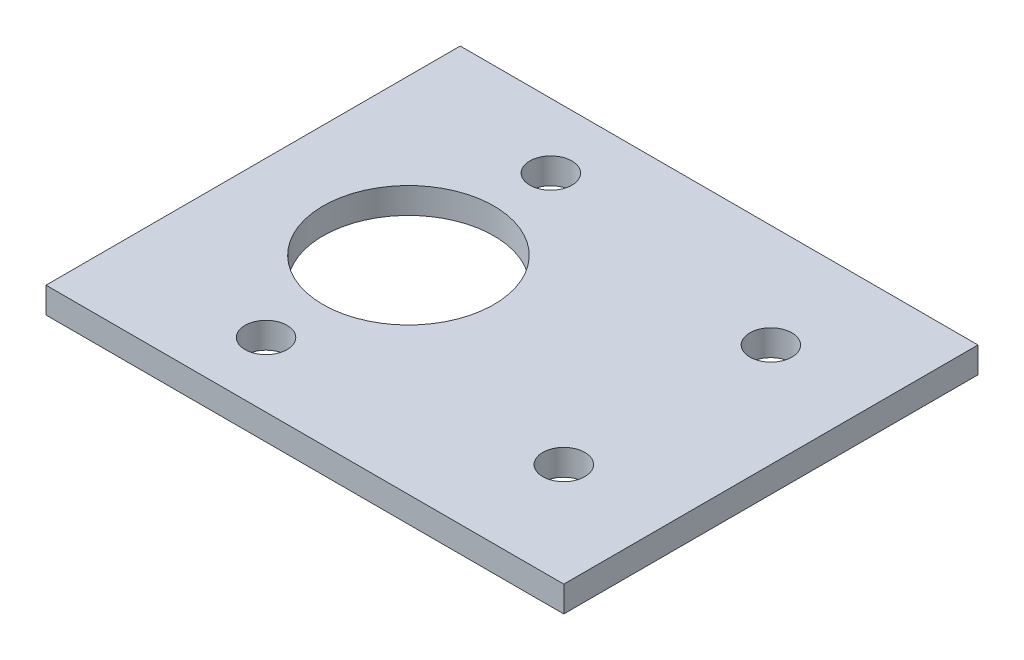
ISO-10303-21;
HEADER;
FILE_DESCRIPTION(('STEP AP214'),'2;1');
FILE_NAME('part.step','',(''),(''),'','','');
FILE_SCHEMA(('AUTOMOTIVE_DESIGN { 1 0 10303 214 1 1 1 1 }'));
ENDSEC;
DATA;
#1=APPLICATION_CONTEXT('core data for automotive mechanical design processes');
#2=APPLICATION_PROTOCOL_DEFINITION('international standard','automotive_design',2000,#1);
#3=PRODUCT_CONTEXT('',#1,'mechanical');
#4=PRODUCT('Part','Part','',(#3));
#5=PRODUCT_RELATED_PRODUCT_CATEGORY('part','',(#4));
#6=PRODUCT_DEFINITION_FORMATION('','',#4);
#7=PRODUCT_DEFINITION_CONTEXT('part definition',#1,'design');
#8=PRODUCT_DEFINITION('design','',#6,#7);
#9=PRODUCT_DEFINITION_SHAPE('','',#8);
#10=(LENGTH_UNIT() NAMED_UNIT(*) SI_UNIT(.MILLI.,.METRE.));
#11=(NAMED_UNIT(*) PLANE_ANGLE_UNIT() SI_UNIT($,.RADIAN.));
#12=(NAMED_UNIT(*) SI_UNIT($,.STERADIAN.) SOLID_ANGLE_UNIT());
#13=UNCERTAINTY_MEASURE_WITH_UNIT(LENGTH_MEASURE(1.E-05),#10,'distance_accuracy_value','');
#14=(GEOMETRIC_REPRESENTATION_CONTEXT(3) GLOBAL_UNCERTAINTY_ASSIGNED_CONTEXT((#13)) GLOBAL_UNIT_ASSIGNED_CONTEXT((#10,
#11,#12)) REPRESENTATION_CONTEXT('',''));
#15=CARTESIAN_POINT('',(0.,0.,0.));
#16=DIRECTION('',(0.,0.,1.));
#17=DIRECTION('',(1.,0.,0.));
#18=AXIS2_PLACEMENT_3D('',#15,#16,#17);
#19=CARTESIAN_POINT('',(0.,12.7,0.));
#20=DIRECTION('',(-1.,0.,0.));
#21=DIRECTION('',(0.,0.,1.));
#22=AXIS2_PLACEMENT_3D('',#19,#20,#21);
#23=PLANE('',#22);
#24=DIRECTION('',(0.,0.,-1.));
#25=VECTOR('',#24,1.);
#26=CARTESIAN_POINT('',(0.,0.,0.));
#27=LINE('',#26,#25);
#28=CARTESIAN_POINT('',(0.,0.,203.2));
#29=VERTEX_POINT('',#28);
#30=CARTESIAN_POINT('',(0.,0.,0.));
#31=VERTEX_POINT('',#30);
#32=EDGE_CURVE('E94',#29,#31,#27,.T.);
#33=ORIENTED_EDGE('',*,*,#32,.T.);
#34=DIRECTION('',(0.,-1.,0.));
#35=VECTOR('',#34,1.);
#36=CARTESIAN_POINT('',(0.,12.7,0.));
#37=LINE('',#36,#35);
#38=CARTESIAN_POINT('',(0.,12.7,0.));
#39=VERTEX_POINT('',#38);
#40=EDGE_CURVE('E11',#39,#31,#37,.T.);
#41=ORIENTED_EDGE('',*,*,#40,.F.);
#42=DIRECTION('',(0.,0.,-1.));
#43=VECTOR('',#42,1.);
#44=CARTESIAN_POINT('',(0.,12.7,0.));
#45=LINE('',#44,#43);
#46=CARTESIAN_POINT('',(0.,12.7,203.2));
#47=VERTEX_POINT('',#46);
#48=EDGE_CURVE('E82',#47,#39,#45,.T.);
#49=ORIENTED_EDGE('',*,*,#48,.F.);
#50=DIRECTION('',(0.,-1.,0.));
#51=VECTOR('',#50,1.);
#52=CARTESIAN_POINT('',(0.,12.7,203.2));
#53=LINE('',#52,#51);
#54=EDGE_CURVE('E90',#47,#29,#53,.T.);
#55=ORIENTED_EDGE('',*,*,#54,.T.);
#56=EDGE_LOOP('',(#33,#41,#49,#55));
#57=FACE_BOUND('',#56,.T.);
#58=ADVANCED_FACE('F31',(#57),#23,.F.);
#59=CARTESIAN_POINT('',(0.,12.7,0.));
#60=DIRECTION('',(0.,0.,1.));
#61=DIRECTION('',(1.,0.,0.));
#62=AXIS2_PLACEMENT_3D('',#59,#60,#61);
#63=PLANE('',#62);
#64=DIRECTION('',(-1.,0.,0.));
#65=VECTOR('',#64,1.);
#66=CARTESIAN_POINT('',(0.,0.,0.));
#67=LINE('',#66,#65);
#68=CARTESIAN_POINT('',(-254.,0.,0.));
#69=VERTEX_POINT('',#68);
#70=EDGE_CURVE('E86',#31,#69,#67,.T.);
#71=ORIENTED_EDGE('',*,*,#70,.T.);
#72=DIRECTION('',(0.,-1.,0.));
#73=VECTOR('',#72,1.);
#74=CARTESIAN_POINT('',(-254.,12.7,0.));
#75=LINE('',#74,#73);
#76=CARTESIAN_POINT('',(-254.,12.7,0.));
#77=VERTEX_POINT('',#76);
#78=EDGE_CURVE('E39',#77,#69,#75,.T.);
#79=ORIENTED_EDGE('',*,*,#78,.F.);
#80=DIRECTION('',(-1.,0.,0.));
#81=VECTOR('',#80,1.);
#82=CARTESIAN_POINT('',(0.,12.7,0.));
#83=LINE('',#82,#81);
#84=EDGE_CURVE('E77',#39,#77,#83,.T.);
#85=ORIENTED_EDGE('',*,*,#84,.F.);
#86=ORIENTED_EDGE('',*,*,#40,.T.);
#87=EDGE_LOOP('',(#71,#79,#85,#86));
#88=FACE_BOUND('',#87,.T.);
#89=ADVANCED_FACE('F85',(#88),#63,.F.);
#90=CARTESIAN_POINT('',(-254.,12.7,0.));
#91=DIRECTION('',(1.,0.,0.));
#92=DIRECTION('',(0.,0.,-1.));
#93=AXIS2_PLACEMENT_3D('',#90,#91,#92);
#94=PLANE('',#93);
#95=DIRECTION('',(0.,0.,1.));
#96=VECTOR('',#95,1.);
#97=CARTESIAN_POINT('',(-254.,0.,0.));
#98=LINE('',#97,#96);
#99=CARTESIAN_POINT('',(-254.,0.,203.2));
#100=VERTEX_POINT('',#99);
#101=EDGE_CURVE('E64',#69,#100,#98,.T.);
#102=ORIENTED_EDGE('',*,*,#101,.T.);
#103=DIRECTION('',(0.,-1.,0.));
#104=VECTOR('',#103,1.);
#105=CARTESIAN_POINT('',(-254.,12.7,203.2));
#106=LINE('',#105,#104);
#107=CARTESIAN_POINT('',(-254.,12.7,203.2));
#108=VERTEX_POINT('',#107);
#109=EDGE_CURVE('E87',#108,#100,#106,.T.);
#110=ORIENTED_EDGE('',*,*,#109,.F.);
#111=DIRECTION('',(0.,0.,1.));
#112=VECTOR('',#111,1.);
#113=CARTESIAN_POINT('',(-254.,12.7,0.));
#114=LINE('',#113,#112);
#115=EDGE_CURVE('E80',#77,#108,#114,.T.);
#116=ORIENTED_EDGE('',*,*,#115,.F.);
#117=ORIENTED_EDGE('',*,*,#78,.T.);
#118=EDGE_LOOP('',(#102,#110,#116,#117));
#119=FACE_BOUND('',#118,.T.);
#120=ADVANCED_FACE('F88',(#119),#94,.F.);
#121=CARTESIAN_POINT('',(0.,12.7,203.2));
#122=DIRECTION('',(0.,0.,-1.));
#123=DIRECTION('',(-1.,0.,0.));
#124=AXIS2_PLACEMENT_3D('',#121,#122,#123);
#125=PLANE('',#124);
#126=DIRECTION('',(1.,0.,0.));
#127=VECTOR('',#126,1.);
#128=CARTESIAN_POINT('',(0.,0.,203.2));
#129=LINE('',#128,#127);
#130=EDGE_CURVE('E70',#100,#29,#129,.T.);
#131=ORIENTED_EDGE('',*,*,#130,.T.);
#132=ORIENTED_EDGE('',*,*,#54,.F.);
#133=DIRECTION('',(1.,0.,0.));
#134=VECTOR('',#133,1.);
#135=CARTESIAN_POINT('',(0.,12.7,203.2));
#136=LINE('',#135,#134);
#137=EDGE_CURVE('E47',#108,#47,#136,.T.);
#138=ORIENTED_EDGE('',*,*,#137,.F.);
#139=ORIENTED_EDGE('',*,*,#109,.T.);
#140=EDGE_LOOP('',(#131,#132,#138,#139));
#141=FACE_BOUND('',#140,.T.);
#142=ADVANCED_FACE('F102',(#141),#125,.F.);
#143=CARTESIAN_POINT('',(0.,12.7,0.));
#144=DIRECTION('',(0.,-1.,0.));
#145=DIRECTION('',(0.,0.,-1.));
#146=AXIS2_PLACEMENT_3D('',#143,#144,#145);
#147=PLANE('',#146);
#148=CARTESIAN_POINT('',(-177.8,12.7,31.75));
#149=DIRECTION('',(0.,1.,0.));
#150=DIRECTION('',(0.,0.,1.));
#151=AXIS2_PLACEMENT_3D('',#148,#149,#150);
#152=CIRCLE('',#151,10.31875);
#153=CARTESIAN_POINT('',(-177.8,12.7,42.06875));
#154=VERTEX_POINT('',#153);
#155=EDGE_CURVE('E132',#154,#154,#152,.T.);
#156=ORIENTED_EDGE('',*,*,#155,.F.);
#157=EDGE_LOOP('',(#156));
#158=FACE_BOUND('',#157,.T.);
#159=CARTESIAN_POINT('',(-177.8,12.7,171.45));
#160=DIRECTION('',(0.,1.,0.));
#161=DIRECTION('',(0.,0.,1.));
#162=AXIS2_PLACEMENT_3D('',#159,#160,#161);
#163=CIRCLE('',#162,10.31875);
#164=CARTESIAN_POINT('',(-177.8,12.7,181.76875));
#165=VERTEX_POINT('',#164);
#166=EDGE_CURVE('E126',#165,#165,#163,.T.);
#167=ORIENTED_EDGE('',*,*,#166,.F.);
#168=EDGE_LOOP('',(#167));
#169=FACE_BOUND('',#168,.T.);
#170=CARTESIAN_POINT('',(-177.8,12.7,101.6));
#171=DIRECTION('',(0.,1.,0.));
#172=DIRECTION('',(0.,0.,1.));
#173=AXIS2_PLACEMENT_3D('',#170,#171,#172);
#174=CIRCLE('',#173,41.91);
#175=CARTESIAN_POINT('',(-177.8,12.7,143.51));
#176=VERTEX_POINT('',#175);
#177=EDGE_CURVE('E120',#176,#176,#174,.T.);
#178=ORIENTED_EDGE('',*,*,#177,.F.);
#179=EDGE_LOOP('',(#178));
#180=FACE_BOUND('',#179,.T.);
#181=CARTESIAN_POINT('',(-50.8,12.7,152.4));
#182=DIRECTION('',(0.,1.,0.));
#183=DIRECTION('',(0.,0.,1.));
#184=AXIS2_PLACEMENT_3D('',#181,#182,#183);
#185=CIRCLE('',#184,10.31875);
#186=CARTESIAN_POINT('',(-50.8,12.7,162.71875));
#187=VERTEX_POINT('',#186);
#188=EDGE_CURVE('E114',#187,#187,#185,.T.);
#189=ORIENTED_EDGE('',*,*,#188,.F.);
#190=EDGE_LOOP('',(#189));
#191=FACE_BOUND('',#190,.T.);
#192=CARTESIAN_POINT('',(-50.8,12.7,50.8));
#193=DIRECTION('',(0.,1.,0.));
#194=DIRECTION('',(0.,0.,1.));
#195=AXIS2_PLACEMENT_3D('',#192,#193,#194);
#196=CIRCLE('',#195,10.31875);
#197=CARTESIAN_POINT('',(-50.8,12.7,61.11875));
#198=VERTEX_POINT('',#197);
#199=EDGE_CURVE('E108',#198,#198,#196,.T.);
#200=ORIENTED_EDGE('',*,*,#199,.F.);
#201=EDGE_LOOP('',(#200));
#202=FACE_BOUND('',#201,.T.);
#203=ORIENTED_EDGE('',*,*,#48,.T.);
#204=ORIENTED_EDGE('',*,*,#84,.T.);
#205=ORIENTED_EDGE('',*,*,#115,.T.);
#206=ORIENTED_EDGE('',*,*,#137,.T.);
#207=EDGE_LOOP('',(#203,#204,#205,#206));
#208=FACE_BOUND('',#207,.T.);
#209=ADVANCED_FACE('F78',(#158,#169,#180,#191,#202,#208),#147,.F.);
#210=CARTESIAN_POINT('',(0.,0.,0.));
#211=DIRECTION('',(0.,-1.,0.));
#212=DIRECTION('',(0.,0.,-1.));
#213=AXIS2_PLACEMENT_3D('',#210,#211,#212);
#214=PLANE('',#213);
#215=CARTESIAN_POINT('',(-177.8,0.,31.75));
#216=DIRECTION('',(0.,1.,0.));
#217=DIRECTION('',(0.,0.,1.));
#218=AXIS2_PLACEMENT_3D('',#215,#216,#217);
#219=CIRCLE('',#218,10.31875);
#220=CARTESIAN_POINT('',(-177.8,0.,42.06875));
#221=VERTEX_POINT('',#220);
#222=EDGE_CURVE('E129',#221,#221,#219,.T.);
#223=ORIENTED_EDGE('',*,*,#222,.T.);
#224=EDGE_LOOP('',(#223));
#225=FACE_BOUND('',#224,.T.);
#226=CARTESIAN_POINT('',(-177.8,0.,171.45));
#227=DIRECTION('',(0.,1.,0.));
#228=DIRECTION('',(0.,0.,1.));
#229=AXIS2_PLACEMENT_3D('',#226,#227,#228);
#230=CIRCLE('',#229,10.31875);
#231=CARTESIAN_POINT('',(-177.8,0.,181.76875));
#232=VERTEX_POINT('',#231);
#233=EDGE_CURVE('E123',#232,#232,#230,.T.);
#234=ORIENTED_EDGE('',*,*,#233,.T.);
#235=EDGE_LOOP('',(#234));
#236=FACE_BOUND('',#235,.T.);
#237=CARTESIAN_POINT('',(-177.8,0.,101.6));
#238=DIRECTION('',(0.,1.,0.));
#239=DIRECTION('',(0.,0.,1.));
#240=AXIS2_PLACEMENT_3D('',#237,#238,#239);
#241=CIRCLE('',#240,41.91);
#242=CARTESIAN_POINT('',(-177.8,0.,143.51));
#243=VERTEX_POINT('',#242);
#244=EDGE_CURVE('E117',#243,#243,#241,.T.);
#245=ORIENTED_EDGE('',*,*,#244,.T.);
#246=EDGE_LOOP('',(#245));
#247=FACE_BOUND('',#246,.T.);
#248=CARTESIAN_POINT('',(-50.8,0.,152.4));
#249=DIRECTION('',(0.,1.,0.));
#250=DIRECTION('',(0.,0.,1.));
#251=AXIS2_PLACEMENT_3D('',#248,#249,#250);
#252=CIRCLE('',#251,10.31875);
#253=CARTESIAN_POINT('',(-50.8,0.,162.71875));
#254=VERTEX_POINT('',#253);
#255=EDGE_CURVE('E111',#254,#254,#252,.T.);
#256=ORIENTED_EDGE('',*,*,#255,.T.);
#257=EDGE_LOOP('',(#256));
#258=FACE_BOUND('',#257,.T.);
#259=CARTESIAN_POINT('',(-50.8,0.,50.8));
#260=DIRECTION('',(0.,1.,0.));
#261=DIRECTION('',(0.,0.,1.));
#262=AXIS2_PLACEMENT_3D('',#259,#260,#261);
#263=CIRCLE('',#262,10.31875);
#264=CARTESIAN_POINT('',(-50.8,0.,61.11875));
#265=VERTEX_POINT('',#264);
#266=EDGE_CURVE('E97',#265,#265,#263,.T.);
#267=ORIENTED_EDGE('',*,*,#266,.T.);
#268=EDGE_LOOP('',(#267));
#269=FACE_BOUND('',#268,.T.);
#270=ORIENTED_EDGE('',*,*,#32,.F.);
#271=ORIENTED_EDGE('',*,*,#130,.F.);
#272=ORIENTED_EDGE('',*,*,#101,.F.);
#273=ORIENTED_EDGE('',*,*,#70,.F.);
#274=EDGE_LOOP('',(#270,#271,#272,#273));
#275=FACE_BOUND('',#274,.T.);
#276=ADVANCED_FACE('F105',(#225,#236,#247,#258,#269,#275),#214,.T.);
#277=CARTESIAN_POINT('',(-50.8,0.,50.8));
#278=DIRECTION('',(0.,1.,0.));
#279=DIRECTION('',(0.,0.,1.));
#280=AXIS2_PLACEMENT_3D('',#277,#278,#279);
#281=CYLINDRICAL_SURFACE('',#280,10.31875);
#282=ORIENTED_EDGE('',*,*,#266,.F.);
#283=EDGE_LOOP('',(#282));
#284=FACE_BOUND('',#283,.T.);
#285=ORIENTED_EDGE('',*,*,#199,.T.);
#286=EDGE_LOOP('',(#285));
#287=FACE_BOUND('',#286,.T.);
#288=ADVANCED_FACE('F158',(#284,#287),#281,.F.);
#289=CARTESIAN_POINT('',(-50.8,0.,152.4));
#290=DIRECTION('',(0.,1.,0.));
#291=DIRECTION('',(0.,0.,1.));
#292=AXIS2_PLACEMENT_3D('',#289,#290,#291);
#293=CYLINDRICAL_SURFACE('',#292,10.31875);
#294=ORIENTED_EDGE('',*,*,#255,.F.);
#295=EDGE_LOOP('',(#294));
#296=FACE_BOUND('',#295,.T.);
#297=ORIENTED_EDGE('',*,*,#188,.T.);
#298=EDGE_LOOP('',(#297));
#299=FACE_BOUND('',#298,.T.);
#300=ADVANCED_FACE('F160',(#296,#299),#293,.F.);
#301=CARTESIAN_POINT('',(-177.8,0.,101.6));
#302=DIRECTION('',(0.,1.,0.));
#303=DIRECTION('',(0.,0.,1.));
#304=AXIS2_PLACEMENT_3D('',#301,#302,#303);
#305=CYLINDRICAL_SURFACE('',#304,41.91);
#306=ORIENTED_EDGE('',*,*,#244,.F.);
#307=EDGE_LOOP('',(#306));
#308=FACE_BOUND('',#307,.T.);
#309=ORIENTED_EDGE('',*,*,#177,.T.);
#310=EDGE_LOOP('',(#309));
#311=FACE_BOUND('',#310,.T.);
#312=ADVANCED_FACE('F167',(#308,#311),#305,.F.);
#313=CARTESIAN_POINT('',(-177.8,0.,171.45));
#314=DIRECTION('',(0.,1.,0.));
#315=DIRECTION('',(0.,0.,1.));
#316=AXIS2_PLACEMENT_3D('',#313,#314,#315);
#317=CYLINDRICAL_SURFACE('',#316,10.31875);
#318=CARTESIAN_POINT('',(-177.8,0.,181.76875));
#319=CARTESIAN_POINT('',(-177.8,0.132291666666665,181.76875));
#320=CARTESIAN_POINT('',(-177.8,0.264583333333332,181.76875));
#321=CARTESIAN_POINT('',(-177.8,0.529166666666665,181.76875));
#322=CARTESIAN_POINT('',(-177.8,0.661458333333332,181.76875));
#323=CARTESIAN_POINT('',(-177.8,0.926041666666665,181.76875));
#324=CARTESIAN_POINT('',(-177.8,1.05833333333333,181.76875));
#325=CARTESIAN_POINT('',(-177.8,1.32291666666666,181.76875));
#326=CARTESIAN_POINT('',(-177.8,1.45520833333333,181.76875));
#327=CARTESIAN_POINT('',(-177.8,1.71979166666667,181.76875));
#328=CARTESIAN_POINT('',(-177.8,1.85208333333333,181.76875));
#329=CARTESIAN_POINT('',(-177.8,2.11666666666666,181.76875));
#330=CARTESIAN_POINT('',(-177.8,2.24895833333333,181.76875));
#331=CARTESIAN_POINT('',(-177.8,2.51354166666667,181.76875));
#332=CARTESIAN_POINT('',(-177.8,2.64583333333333,181.76875));
#333=CARTESIAN_POINT('',(-177.8,2.91041666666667,181.76875));
#334=CARTESIAN_POINT('',(-177.8,3.04270833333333,181.76875));
#335=CARTESIAN_POINT('',(-177.8,3.30729166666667,181.76875));
#336=CARTESIAN_POINT('',(-177.8,3.43958333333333,181.76875));
#337=CARTESIAN_POINT('',(-177.8,3.70416666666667,181.76875));
#338=CARTESIAN_POINT('',(-177.8,3.83645833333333,181.76875));
#339=CARTESIAN_POINT('',(-177.8,4.10104166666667,181.76875));
#340=CARTESIAN_POINT('',(-177.8,4.23333333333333,181.76875));
#341=CARTESIAN_POINT('',(-177.8,4.49791666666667,181.76875));
#342=CARTESIAN_POINT('',(-177.8,4.63020833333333,181.76875));
#343=CARTESIAN_POINT('',(-177.8,4.89479166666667,181.76875));
#344=CARTESIAN_POINT('',(-177.8,5.02708333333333,181.76875));
#345=CARTESIAN_POINT('',(-177.8,5.29166666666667,181.76875));
#346=CARTESIAN_POINT('',(-177.8,5.42395833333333,181.76875));
#347=CARTESIAN_POINT('',(-177.8,5.68854166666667,181.76875));
#348=CARTESIAN_POINT('',(-177.8,5.82083333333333,181.76875));
#349=CARTESIAN_POINT('',(-177.8,6.08541666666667,181.76875));
#350=CARTESIAN_POINT('',(-177.8,6.21770833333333,181.76875));
#351=CARTESIAN_POINT('',(-177.8,6.48229166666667,181.76875));
#352=CARTESIAN_POINT('',(-177.8,6.61458333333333,181.76875));
#353=CARTESIAN_POINT('',(-177.8,6.87916666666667,181.76875));
#354=CARTESIAN_POINT('',(-177.8,7.01145833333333,181.76875));
#355=CARTESIAN_POINT('',(-177.8,7.27604166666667,181.76875));
#356=CARTESIAN_POINT('',(-177.8,7.40833333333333,181.76875));
#357=CARTESIAN_POINT('',(-177.8,7.67291666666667,181.76875));
#358=CARTESIAN_POINT('',(-177.8,7.80520833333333,181.76875));
#359=CARTESIAN_POINT('',(-177.8,8.06979166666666,181.76875));
#360=CARTESIAN_POINT('',(-177.8,8.20208333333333,181.76875));
#361=CARTESIAN_POINT('',(-177.8,8.46666666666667,181.76875));
#362=CARTESIAN_POINT('',(-177.8,8.59895833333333,181.76875));
#363=CARTESIAN_POINT('',(-177.8,8.86354166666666,181.76875));
#364=CARTESIAN_POINT('',(-177.8,8.99583333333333,181.76875));
#365=CARTESIAN_POINT('',(-177.8,9.26041666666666,181.76875));
#366=CARTESIAN_POINT('',(-177.8,9.39270833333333,181.76875));
#367=CARTESIAN_POINT('',(-177.8,9.65729166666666,181.76875));
#368=CARTESIAN_POINT('',(-177.8,9.78958333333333,181.76875));
#369=CARTESIAN_POINT('',(-177.8,10.0541666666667,181.76875));
#370=CARTESIAN_POINT('',(-177.8,10.1864583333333,181.76875));
#371=CARTESIAN_POINT('',(-177.8,10.4510416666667,181.76875));
#372=CARTESIAN_POINT('',(-177.8,10.5833333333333,181.76875));
#373=CARTESIAN_POINT('',(-177.8,10.8479166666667,181.76875));
#374=CARTESIAN_POINT('',(-177.8,10.9802083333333,181.76875));
#375=CARTESIAN_POINT('',(-177.8,11.2447916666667,181.76875));
#376=CARTESIAN_POINT('',(-177.8,11.3770833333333,181.76875));
#377=CARTESIAN_POINT('',(-177.8,11.6416666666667,181.76875));
#378=CARTESIAN_POINT('',(-177.8,11.7739583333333,181.76875));
#379=CARTESIAN_POINT('',(-177.8,12.0385416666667,181.76875));
#380=CARTESIAN_POINT('',(-177.8,12.1708333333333,181.76875));
#381=CARTESIAN_POINT('',(-177.8,12.4354166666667,181.76875));
#382=CARTESIAN_POINT('',(-177.8,12.5677083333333,181.76875));
#383=CARTESIAN_POINT('',(-177.8,12.7,181.76875));
#384=B_SPLINE_CURVE_WITH_KNOTS('',3,(#318,#319,#320,#321,#322,#323,#324,#325,#326,#327,#328,
#329,#330,#331,#332,#333,#334,#335,#336,#337,#338,#339,#340,#341,#342,#343,#344,#345,#346,#347,
#348,#349,#350,#351,#352,#353,#354,#355,#356,#357,#358,#359,#360,#361,#362,#363,#364,#365,#366,
#367,#368,#369,#370,#371,#372,#373,#374,#375,#376,#377,#378,#379,#380,#381,#382,#383),
.UNSPECIFIED.,.F.,.F.,(4,2,2,2,2,2,2,2,2,2,2,2,2,2,2,2,2,2,2,2,2,2,2,2,2,2,2,2,2,2,2,2,4),(0.,
0.396875,0.79375,1.190625,1.5875,1.984375,2.38125,2.778125,3.175,3.571875,3.96875,4.365625,
4.7625,5.159375,5.55625,5.953125,6.35,6.746875,7.14375,7.540625,7.9375,8.334375,8.73125,
9.128125,9.525,9.921875,10.31875,10.715625,11.1125,11.509375,11.90625,12.303125,12.7),.UNSPECIFIED.);
#385=EDGE_CURVE('BSEAM143',#232,#165,#384,.T.);
#386=ORIENTED_EDGE('',*,*,#233,.F.);
#387=ORIENTED_EDGE('',*,*,#166,.T.);
#388=ORIENTED_EDGE('',*,*,#385,.T.);
#389=ORIENTED_EDGE('',*,*,#385,.F.);
#390=EDGE_LOOP('',(#386,#388,#387,#389));
#391=FACE_BOUND('',#390,.T.);
#392=ADVANCED_FACE('F143',(#391),#317,.F.);
#393=CARTESIAN_POINT('',(-177.8,0.,31.75));
#394=DIRECTION('',(0.,1.,0.));
#395=DIRECTION('',(0.,0.,1.));
#396=AXIS2_PLACEMENT_3D('',#393,#394,#395);
#397=CYLINDRICAL_SURFACE('',#396,10.31875);
#398=CARTESIAN_POINT('',(-177.8,0.,42.06875));
#399=CARTESIAN_POINT('',(-177.8,0.132291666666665,42.06875));
#400=CARTESIAN_POINT('',(-177.8,0.264583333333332,42.06875));
#401=CARTESIAN_POINT('',(-177.8,0.529166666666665,42.06875));
#402=CARTESIAN_POINT('',(-177.8,0.661458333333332,42.06875));
#403=CARTESIAN_POINT('',(-177.8,0.926041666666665,42.06875));
#404=CARTESIAN_POINT('',(-177.8,1.05833333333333,42.06875));
#405=CARTESIAN_POINT('',(-177.8,1.32291666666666,42.06875));
#406=CARTESIAN_POINT('',(-177.8,1.45520833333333,42.06875));
#407=CARTESIAN_POINT('',(-177.8,1.71979166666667,42.06875));
#408=CARTESIAN_POINT('',(-177.8,1.85208333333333,42.06875));
#409=CARTESIAN_POINT('',(-177.8,2.11666666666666,42.06875));
#410=CARTESIAN_POINT('',(-177.8,2.24895833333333,42.06875));
#411=CARTESIAN_POINT('',(-177.8,2.51354166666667,42.06875));
#412=CARTESIAN_POINT('',(-177.8,2.64583333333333,42.06875));
#413=CARTESIAN_POINT('',(-177.8,2.91041666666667,42.06875));
#414=CARTESIAN_POINT('',(-177.8,3.04270833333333,42.06875));
#415=CARTESIAN_POINT('',(-177.8,3.30729166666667,42.06875));
#416=CARTESIAN_POINT('',(-177.8,3.43958333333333,42.06875));
#417=CARTESIAN_POINT('',(-177.8,3.70416666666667,42.06875));
#418=CARTESIAN_POINT('',(-177.8,3.83645833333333,42.06875));
#419=CARTESIAN_POINT('',(-177.8,4.10104166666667,42.06875));
#420=CARTESIAN_POINT('',(-177.8,4.23333333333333,42.06875));
#421=CARTESIAN_POINT('',(-177.8,4.49791666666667,42.06875));
#422=CARTESIAN_POINT('',(-177.8,4.63020833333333,42.06875));
#423=CARTESIAN_POINT('',(-177.8,4.89479166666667,42.06875));
#424=CARTESIAN_POINT('',(-177.8,5.02708333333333,42.06875));
#425=CARTESIAN_POINT('',(-177.8,5.29166666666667,42.06875));
#426=CARTESIAN_POINT('',(-177.8,5.42395833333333,42.06875));
#427=CARTESIAN_POINT('',(-177.8,5.68854166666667,42.06875));
#428=CARTESIAN_POINT('',(-177.8,5.82083333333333,42.06875));
#429=CARTESIAN_POINT('',(-177.8,6.08541666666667,42.06875));
#430=CARTESIAN_POINT('',(-177.8,6.21770833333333,42.06875));
#431=CARTESIAN_POINT('',(-177.8,6.48229166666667,42.06875));
#432=CARTESIAN_POINT('',(-177.8,6.61458333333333,42.06875));
#433=CARTESIAN_POINT('',(-177.8,6.87916666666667,42.06875));
#434=CARTESIAN_POINT('',(-177.8,7.01145833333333,42.06875));
#435=CARTESIAN_POINT('',(-177.8,7.27604166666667,42.06875));
#436=CARTESIAN_POINT('',(-177.8,7.40833333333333,42.06875));
#437=CARTESIAN_POINT('',(-177.8,7.67291666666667,42.06875));
#438=CARTESIAN_POINT('',(-177.8,7.80520833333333,42.06875));
#439=CARTESIAN_POINT('',(-177.8,8.06979166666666,42.06875));
#440=CARTESIAN_POINT('',(-177.8,8.20208333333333,42.06875));
#441=CARTESIAN_POINT('',(-177.8,8.46666666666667,42.06875));
#442=CARTESIAN_POINT('',(-177.8,8.59895833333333,42.06875));
#443=CARTESIAN_POINT('',(-177.8,8.86354166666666,42.06875));
#444=CARTESIAN_POINT('',(-177.8,8.99583333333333,42.06875));
#445=CARTESIAN_POINT('',(-177.8,9.26041666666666,42.06875));
#446=CARTESIAN_POINT('',(-177.8,9.39270833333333,42.06875));
#447=CARTESIAN_POINT('',(-177.8,9.65729166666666,42.06875));
#448=CARTESIAN_POINT('',(-177.8,9.78958333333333,42.06875));
#449=CARTESIAN_POINT('',(-177.8,10.0541666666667,42.06875));
#450=CARTESIAN_POINT('',(-177.8,10.1864583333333,42.06875));
#451=CARTESIAN_POINT('',(-177.8,10.4510416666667,42.06875));
#452=CARTESIAN_POINT('',(-177.8,10.5833333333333,42.06875));
#453=CARTESIAN_POINT('',(-177.8,10.8479166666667,42.06875));
#454=CARTESIAN_POINT('',(-177.8,10.9802083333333,42.06875));
#455=CARTESIAN_POINT('',(-177.8,11.2447916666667,42.06875));
#456=CARTESIAN_POINT('',(-177.8,11.3770833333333,42.06875));
#457=CARTESIAN_POINT('',(-177.8,11.6416666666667,42.06875));
#458=CARTESIAN_POINT('',(-177.8,11.7739583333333,42.06875));
#459=CARTESIAN_POINT('',(-177.8,12.0385416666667,42.06875));
#460=CARTESIAN_POINT('',(-177.8,12.1708333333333,42.06875));
#461=CARTESIAN_POINT('',(-177.8,12.4354166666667,42.06875));
#462=CARTESIAN_POINT('',(-177.8,12.5677083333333,42.06875));
#463=CARTESIAN_POINT('',(-177.8,12.7,42.06875));
#464=B_SPLINE_CURVE_WITH_KNOTS('',3,(#398,#399,#400,#401,#402,#403,#404,#405,#406,#407,#408,
#409,#410,#411,#412,#413,#414,#415,#416,#417,#418,#419,#420,#421,#422,#423,#424,#425,#426,#427,
#428,#429,#430,#431,#432,#433,#434,#435,#436,#437,#438,#439,#440,#441,#442,#443,#444,#445,#446,
#447,#448,#449,#450,#451,#452,#453,#454,#455,#456,#457,#458,#459,#460,#461,#462,#463),
.UNSPECIFIED.,.F.,.F.,(4,2,2,2,2,2,2,2,2,2,2,2,2,2,2,2,2,2,2,2,2,2,2,2,2,2,2,2,2,2,2,2,4),(0.,
0.396875,0.79375,1.190625,1.5875,1.984375,2.38125,2.778125,3.175,3.571875,3.96875,4.365625,
4.7625,5.159375,5.55625,5.953125,6.35,6.746875,7.14375,7.540625,7.9375,8.334375,8.73125,
9.128125,9.525,9.921875,10.31875,10.715625,11.1125,11.509375,11.90625,12.303125,12.7),.UNSPECIFIED.);
#465=EDGE_CURVE('BSEAM140',#221,#154,#464,.T.);
#466=ORIENTED_EDGE('',*,*,#222,.F.);
#467=ORIENTED_EDGE('',*,*,#155,.T.);
#468=ORIENTED_EDGE('',*,*,#465,.T.);
#469=ORIENTED_EDGE('',*,*,#465,.F.);
#470=EDGE_LOOP('',(#466,#468,#467,#469));
#471=FACE_BOUND('',#470,.T.);
#472=ADVANCED_FACE('F140',(#471),#397,.F.);
#473=CLOSED_SHELL('',(#58,#89,#120,#142,#209,#276,#288,#300,#312,#392,#472));
#474=MANIFOLD_SOLID_BREP('B2',#473);
#475=ADVANCED_BREP_SHAPE_REPRESENTATION('',(#18,#474),#14);
#476=SHAPE_DEFINITION_REPRESENTATION(#9,#475);
ENDSEC;
END-ISO-10303-21;
